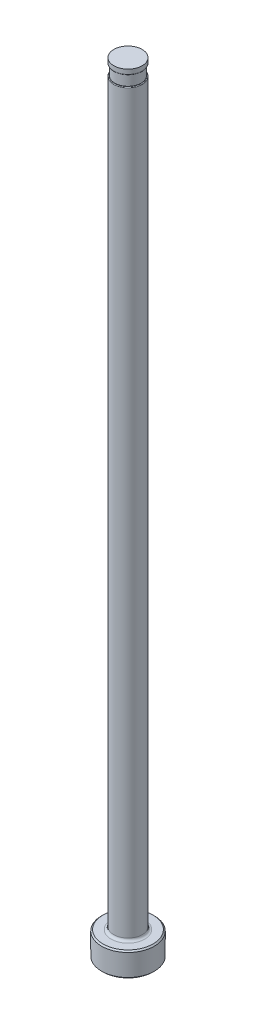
from build123d import *

# Parameters (mm, degrees)
CHAMFER1_SIZE     = 0.254
FILLET1_R         = 0.508
SKETCH2_W         = 0.2032
SKETCH2_H         = 2.032
D_SLOT_DEPTH      = 153.574351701
D_SLOT_DEPTH_BACK = 153.574351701
SKETCH5_W         = 0.00508
SKETCH5_H         = 1.016
FILLET2_R         = 0.127


with BuildPart() as part:
    # Sketch1 → Revolve1 (revolve)
    with BuildSketch(Plane.XY, mode=Mode.PRIVATE) as revolve1_sk:
        Polygon((0, 0), (-5.1562, 0), (-5.1562, 4.7498), (-2.77749, 4.7498), (-2.77749, 152.4), (0, 152.4), align=None)
    revolve(revolve1_sk.sketch.rotate(Axis((0, 259.958771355, 0), (0, -1, 0)), 270), axis=Axis((0, 259.958771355, 0), (0, -1, 0)))

    # Chamfer1
    chamfer1_edges = [part.edges().sort_by_distance(p)[0] for p in [
        (0, 4.7498, -5.1562),
        (0, 0, -5.1562),
    ]]
    chamfer(chamfer1_edges, length=CHAMFER1_SIZE)

    # Fillet1
    fillet1_edges = [part.edges().sort_by_distance(p)[0] for p in [
        (0, 4.7498, -2.77749),
    ]]
    fillet(fillet1_edges, radius=FILLET1_R)

    # Sketch2 → Vent Relief (revolve, cut)
    with BuildSketch(Plane.XY, mode=Mode.PRIVATE) as vent_relief_sk:
        with Locations((-2.67589, 150.368)):
            Rectangle(SKETCH2_W, SKETCH2_H)
    revolve(vent_relief_sk.sketch.rotate(Axis((0, 153.448281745, 0), (0, -1, 0)), 270), axis=Axis((0, 153.448281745, 0), (0, -1, 0)), mode=Mode.SUBTRACT)

    # Sketch3 → D-Slot (cut, two sides: drawn at the far end of the back side and taken through both)
    with BuildSketch(Plane.XY.offset(-D_SLOT_DEPTH_BACK)):
        with BuildLine():
            Line((-2.57429, 150.368), (-2.57429, 86.868))
            ThreePointArc((-2.57429, 86.868), (-2.625503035, 86.300038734), (-2.77749, 85.7504))
            Line((-2.77749, 85.7504), (-2.77749, 150.368))
            Line((-2.77749, 150.368), (-2.57429, 150.368))
        make_face()
    extrude(amount=D_SLOT_DEPTH + D_SLOT_DEPTH_BACK, mode=Mode.SUBTRACT)

    # Sketch5 → Vent Diameter (revolve, cut)
    with BuildSketch(Plane.XY, mode=Mode.PRIVATE) as vent_diameter_sk:
        with Locations((-2.77495, 151.892)):
            Rectangle(SKETCH5_W, SKETCH5_H)
    revolve(vent_diameter_sk.sketch.rotate(Axis((0, 152.687735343, 0), (0, -1, 0)), 90), axis=Axis((0, 152.687735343, 0), (0, -1, 0)), mode=Mode.SUBTRACT)

    # Fillet2
    fillet2_edges = [part.edges().sort_by_distance(p)[0] for p in [
        (2.303354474, 149.352, -1.552098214),
        (0, 151.384, 2.77241),
    ]]
    fillet(fillet2_edges, radius=FILLET2_R)


solid = part.part
